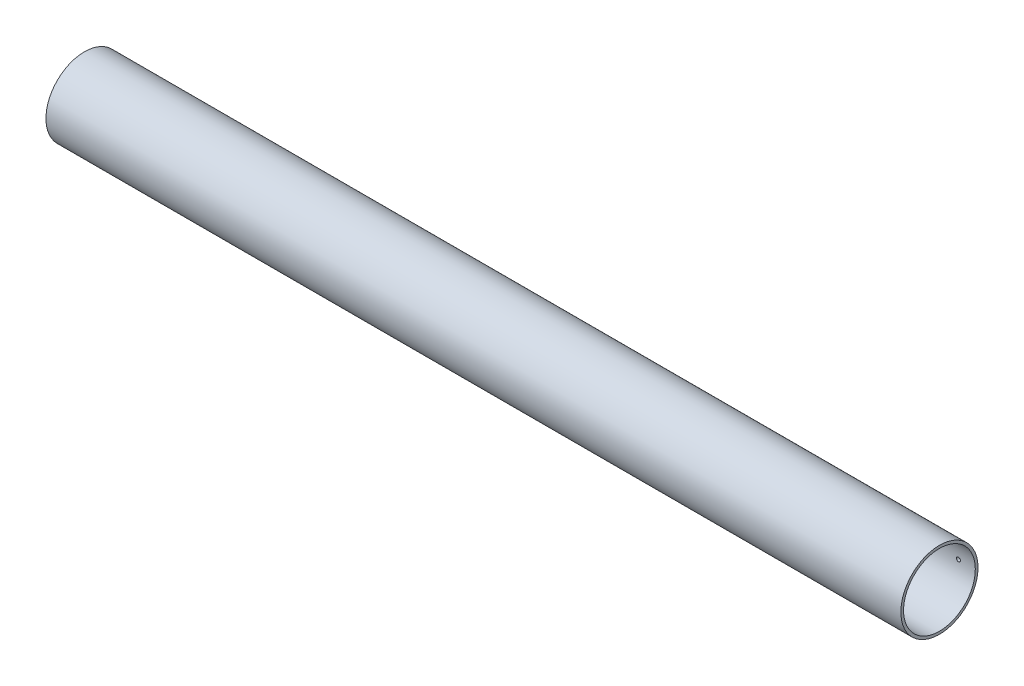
from build123d import *

# Parameters (mm, degrees)
SKETCH1_R          = 29.083
SKETCH1_R_2        = 27.051
EXTRUDE1_DEPTH     = 644.525
SKETCH2_R          = 1.524
CUT_EXTRUDE1_DEPTH = 646.83598336


with BuildPart() as part:
    # Sketch1 → Extrude1 (new body)
    with BuildSketch(Plane(origin=(0, 0, 0), x_dir=(0, 0, -1), z_dir=(1, 0, 0))):
        Circle(SKETCH1_R)
        Circle(SKETCH1_R_2, mode=Mode.SUBTRACT)
    extrude(amount=EXTRUDE1_DEPTH)

    # Sketch2 → Cut-Extrude1 (cut, through all)
    with BuildSketch(Plane.XY):
        with Locations((10.16, 0)):
            Circle(SKETCH2_R)
        with Locations((631.825, 0)):
            Circle(SKETCH2_R)
    extrude(amount=-CUT_EXTRUDE1_DEPTH, mode=Mode.SUBTRACT)


solid = part.part
